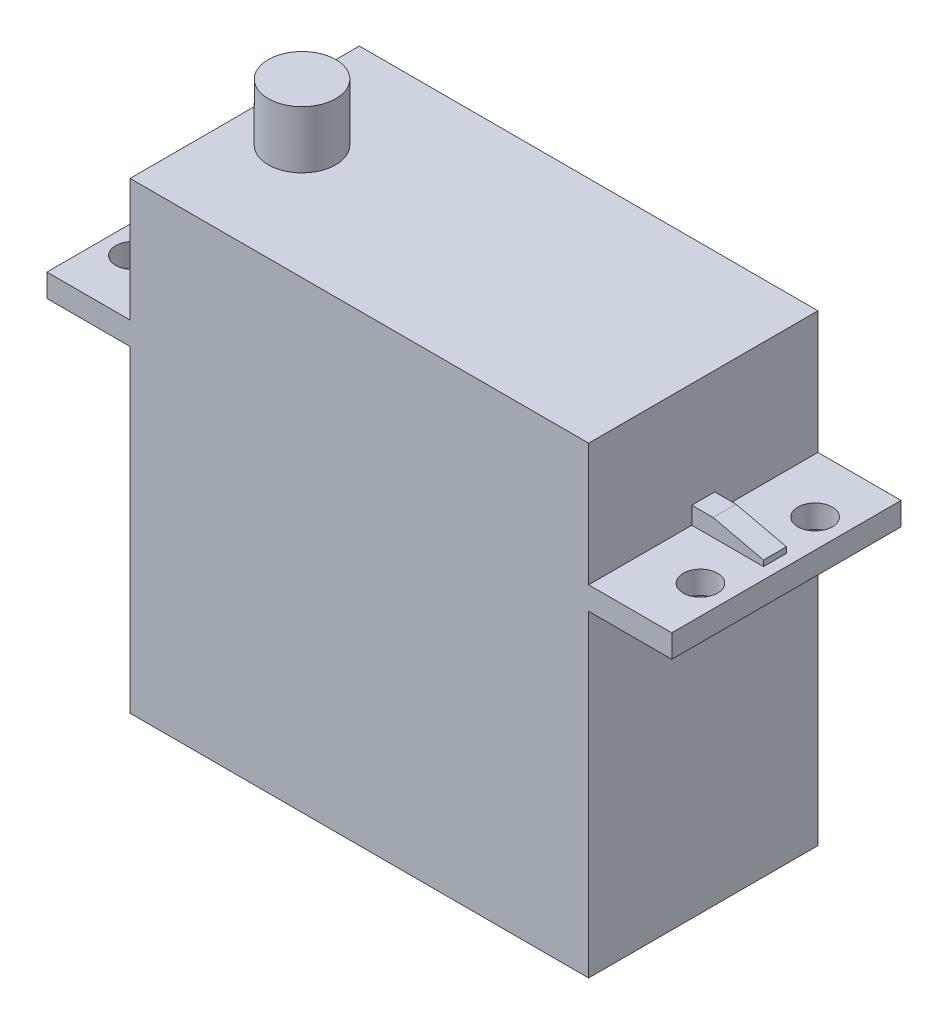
ISO-10303-21;
HEADER;
FILE_DESCRIPTION(('STEP AP214'),'2;1');
FILE_NAME('part.step','',(''),(''),'','','');
FILE_SCHEMA(('AUTOMOTIVE_DESIGN { 1 0 10303 214 1 1 1 1 }'));
ENDSEC;
DATA;
#1=APPLICATION_CONTEXT('core data for automotive mechanical design processes');
#2=APPLICATION_PROTOCOL_DEFINITION('international standard','automotive_design',2000,#1);
#3=PRODUCT_CONTEXT('',#1,'mechanical');
#4=PRODUCT('Part','Part','',(#3));
#5=PRODUCT_RELATED_PRODUCT_CATEGORY('part','',(#4));
#6=PRODUCT_DEFINITION_FORMATION('','',#4);
#7=PRODUCT_DEFINITION_CONTEXT('part definition',#1,'design');
#8=PRODUCT_DEFINITION('design','',#6,#7);
#9=PRODUCT_DEFINITION_SHAPE('','',#8);
#10=(LENGTH_UNIT() NAMED_UNIT(*) SI_UNIT(.MILLI.,.METRE.));
#11=(NAMED_UNIT(*) PLANE_ANGLE_UNIT() SI_UNIT($,.RADIAN.));
#12=(NAMED_UNIT(*) SI_UNIT($,.STERADIAN.) SOLID_ANGLE_UNIT());
#13=UNCERTAINTY_MEASURE_WITH_UNIT(LENGTH_MEASURE(1.E-05),#10,'distance_accuracy_value','');
#14=(GEOMETRIC_REPRESENTATION_CONTEXT(3) GLOBAL_UNCERTAINTY_ASSIGNED_CONTEXT((#13)) GLOBAL_UNIT_ASSIGNED_CONTEXT((#10,
#11,#12)) REPRESENTATION_CONTEXT('',''));
#15=CARTESIAN_POINT('',(0.,0.,0.));
#16=DIRECTION('',(0.,0.,1.));
#17=DIRECTION('',(1.,0.,0.));
#18=AXIS2_PLACEMENT_3D('',#15,#16,#17);
#19=CARTESIAN_POINT('',(20.,40.4,10.));
#20=DIRECTION('',(-1.,0.,0.));
#21=DIRECTION('',(0.,0.,1.));
#22=AXIS2_PLACEMENT_3D('',#19,#20,#21);
#23=PLANE('',#22);
#24=DIRECTION('',(0.,-1.,0.));
#25=VECTOR('',#24,1.);
#26=CARTESIAN_POINT('',(20.,31.2134680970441,-1.));
#27=LINE('',#26,#25);
#28=CARTESIAN_POINT('',(20.,31.2134680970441,-1.));
#29=VERTEX_POINT('',#28);
#30=CARTESIAN_POINT('',(20.,29.7,-1.));
#31=VERTEX_POINT('',#30);
#32=EDGE_CURVE('E214',#29,#31,#27,.T.);
#33=ORIENTED_EDGE('',*,*,#32,.T.);
#34=DIRECTION('',(0.,0.,1.));
#35=VECTOR('',#34,1.);
#36=CARTESIAN_POINT('',(20.,29.7,-17.5208044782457));
#37=LINE('',#36,#35);
#38=CARTESIAN_POINT('',(20.,29.7,-10.));
#39=VERTEX_POINT('',#38);
#40=EDGE_CURVE('E308',#39,#31,#37,.T.);
#41=ORIENTED_EDGE('',*,*,#40,.F.);
#42=DIRECTION('',(0.,-1.,0.));
#43=VECTOR('',#42,1.);
#44=CARTESIAN_POINT('',(20.,40.4,-10.));
#45=LINE('',#44,#43);
#46=CARTESIAN_POINT('',(20.,40.4,-10.));
#47=VERTEX_POINT('',#46);
#48=EDGE_CURVE('E54',#47,#39,#45,.T.);
#49=ORIENTED_EDGE('',*,*,#48,.F.);
#50=DIRECTION('',(0.,0.,-1.));
#51=VECTOR('',#50,1.);
#52=CARTESIAN_POINT('',(20.,40.4,10.));
#53=LINE('',#52,#51);
#54=CARTESIAN_POINT('',(20.,40.4,10.));
#55=VERTEX_POINT('',#54);
#56=EDGE_CURVE('E374',#55,#47,#53,.T.);
#57=ORIENTED_EDGE('',*,*,#56,.F.);
#58=DIRECTION('',(0.,-1.,0.));
#59=VECTOR('',#58,1.);
#60=CARTESIAN_POINT('',(20.,40.4,10.));
#61=LINE('',#60,#59);
#62=CARTESIAN_POINT('',(20.,29.7,10.));
#63=VERTEX_POINT('',#62);
#64=EDGE_CURVE('E403',#55,#63,#61,.T.);
#65=ORIENTED_EDGE('',*,*,#64,.T.);
#66=CARTESIAN_POINT('',(20.,29.7,1.));
#67=VERTEX_POINT('',#66);
#68=EDGE_CURVE('E312',#67,#63,#37,.T.);
#69=ORIENTED_EDGE('',*,*,#68,.F.);
#70=DIRECTION('',(0.,-1.,0.));
#71=VECTOR('',#70,1.);
#72=CARTESIAN_POINT('',(20.,31.2134680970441,1.));
#73=LINE('',#72,#71);
#74=CARTESIAN_POINT('',(20.,31.2134680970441,0.999999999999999));
#75=VERTEX_POINT('',#74);
#76=EDGE_CURVE('E66',#75,#67,#73,.T.);
#77=ORIENTED_EDGE('',*,*,#76,.F.);
#78=DIRECTION('',(0.,0.,1.));
#79=VECTOR('',#78,1.);
#80=CARTESIAN_POINT('',(20.,31.2134680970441,-1.));
#81=LINE('',#80,#79);
#82=EDGE_CURVE('E61',#29,#75,#81,.T.);
#83=ORIENTED_EDGE('',*,*,#82,.F.);
#84=EDGE_LOOP('',(#33,#41,#49,#57,#65,#69,#77,#83));
#85=FACE_BOUND('',#84,.T.);
#86=ADVANCED_FACE('F45',(#85),#23,.F.);
#87=CARTESIAN_POINT('',(27.25,29.7,-17.5208044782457));
#88=DIRECTION('',(0.,1.,0.));
#89=DIRECTION('',(0.,0.,1.));
#90=AXIS2_PLACEMENT_3D('',#87,#88,#89);
#91=PLANE('',#90);
#92=CARTESIAN_POINT('',(24.75,29.7,-5.));
#93=DIRECTION('',(0.,1.,0.));
#94=DIRECTION('',(0.,0.,-1.));
#95=AXIS2_PLACEMENT_3D('',#92,#93,#94);
#96=CIRCLE('',#95,1.5);
#97=CARTESIAN_POINT('',(24.75,29.7,-6.5));
#98=VERTEX_POINT('',#97);
#99=EDGE_CURVE('E793',#98,#98,#96,.T.);
#100=ORIENTED_EDGE('',*,*,#99,.F.);
#101=EDGE_LOOP('',(#100));
#102=FACE_BOUND('',#101,.T.);
#103=CARTESIAN_POINT('',(24.75,29.7,5.));
#104=DIRECTION('',(0.,1.,0.));
#105=DIRECTION('',(0.,0.,-1.));
#106=AXIS2_PLACEMENT_3D('',#103,#104,#105);
#107=CIRCLE('',#106,1.5);
#108=CARTESIAN_POINT('',(24.75,29.7,3.5));
#109=VERTEX_POINT('',#108);
#110=EDGE_CURVE('E802',#109,#109,#107,.T.);
#111=ORIENTED_EDGE('',*,*,#110,.F.);
#112=EDGE_LOOP('',(#111));
#113=FACE_BOUND('',#112,.T.);
#114=ORIENTED_EDGE('',*,*,#40,.T.);
#115=DIRECTION('',(1.,0.,0.));
#116=VECTOR('',#115,1.);
#117=CARTESIAN_POINT('',(20.,29.7,-1.));
#118=LINE('',#117,#116);
#119=CARTESIAN_POINT('',(26.25,29.7,-0.999999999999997));
#120=VERTEX_POINT('',#119);
#121=EDGE_CURVE('E225',#31,#120,#118,.T.);
#122=ORIENTED_EDGE('',*,*,#121,.T.);
#123=DIRECTION('',(0.,0.,1.));
#124=VECTOR('',#123,1.);
#125=CARTESIAN_POINT('',(26.25,29.7,-1.));
#126=LINE('',#125,#124);
#127=CARTESIAN_POINT('',(26.25,29.7,1.));
#128=VERTEX_POINT('',#127);
#129=EDGE_CURVE('E227',#120,#128,#126,.T.);
#130=ORIENTED_EDGE('',*,*,#129,.T.);
#131=DIRECTION('',(1.,0.,0.));
#132=VECTOR('',#131,1.);
#133=CARTESIAN_POINT('',(20.,29.7,1.));
#134=LINE('',#133,#132);
#135=EDGE_CURVE('E241',#67,#128,#134,.T.);
#136=ORIENTED_EDGE('',*,*,#135,.F.);
#137=ORIENTED_EDGE('',*,*,#68,.T.);
#138=DIRECTION('',(-1.,0.,0.));
#139=VECTOR('',#138,1.);
#140=CARTESIAN_POINT('',(27.25,29.7,10.));
#141=LINE('',#140,#139);
#142=CARTESIAN_POINT('',(27.25,29.7,10.));
#143=VERTEX_POINT('',#142);
#144=EDGE_CURVE('E323',#143,#63,#141,.T.);
#145=ORIENTED_EDGE('',*,*,#144,.F.);
#146=DIRECTION('',(0.,0.,1.));
#147=VECTOR('',#146,1.);
#148=CARTESIAN_POINT('',(27.25,29.7,-17.5208044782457));
#149=LINE('',#148,#147);
#150=CARTESIAN_POINT('',(27.25,29.7,-10.));
#151=VERTEX_POINT('',#150);
#152=EDGE_CURVE('E304',#151,#143,#149,.T.);
#153=ORIENTED_EDGE('',*,*,#152,.F.);
#154=DIRECTION('',(1.,0.,0.));
#155=VECTOR('',#154,1.);
#156=CARTESIAN_POINT('',(27.25,29.7,-10.));
#157=LINE('',#156,#155);
#158=EDGE_CURVE('E291',#39,#151,#157,.T.);
#159=ORIENTED_EDGE('',*,*,#158,.F.);
#160=EDGE_LOOP('',(#114,#122,#130,#136,#137,#145,#153,#159));
#161=FACE_BOUND('',#160,.T.);
#162=ADVANCED_FACE('F448',(#102,#113,#161),#91,.T.);
#163=CARTESIAN_POINT('',(-20.,40.4,10.));
#164=DIRECTION('',(1.,0.,0.));
#165=DIRECTION('',(0.,0.,-1.));
#166=AXIS2_PLACEMENT_3D('',#163,#164,#165);
#167=PLANE('',#166);
#168=DIRECTION('',(0.,0.,1.));
#169=VECTOR('',#168,1.);
#170=CARTESIAN_POINT('',(-20.,27.7,-17.5208044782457));
#171=LINE('',#170,#169);
#172=CARTESIAN_POINT('',(-20.,27.7,-10.));
#173=VERTEX_POINT('',#172);
#174=CARTESIAN_POINT('',(-20.,27.7,10.));
#175=VERTEX_POINT('',#174);
#176=EDGE_CURVE('E341',#173,#175,#171,.T.);
#177=ORIENTED_EDGE('',*,*,#176,.F.);
#178=DIRECTION('',(0.,-1.,0.));
#179=VECTOR('',#178,1.);
#180=CARTESIAN_POINT('',(-20.,40.4,-10.));
#181=LINE('',#180,#179);
#182=CARTESIAN_POINT('',(-20.,0.,-10.));
#183=VERTEX_POINT('',#182);
#184=EDGE_CURVE('E412',#173,#183,#181,.T.);
#185=ORIENTED_EDGE('',*,*,#184,.T.);
#186=DIRECTION('',(0.,0.,1.));
#187=VECTOR('',#186,1.);
#188=CARTESIAN_POINT('',(-20.,0.,10.));
#189=LINE('',#188,#187);
#190=CARTESIAN_POINT('',(-20.,0.,10.));
#191=VERTEX_POINT('',#190);
#192=EDGE_CURVE('E396',#183,#191,#189,.T.);
#193=ORIENTED_EDGE('',*,*,#192,.T.);
#194=DIRECTION('',(0.,-1.,0.));
#195=VECTOR('',#194,1.);
#196=CARTESIAN_POINT('',(-20.,40.4,10.));
#197=LINE('',#196,#195);
#198=EDGE_CURVE('E407',#175,#191,#197,.T.);
#199=ORIENTED_EDGE('',*,*,#198,.F.);
#200=EDGE_LOOP('',(#177,#185,#193,#199));
#201=FACE_BOUND('',#200,.T.);
#202=ADVANCED_FACE('F441',(#201),#167,.F.);
#203=CARTESIAN_POINT('',(20.,27.7,-10.));
#204=VERTEX_POINT('',#203);
#205=CARTESIAN_POINT('',(20.,0.,-10.));
#206=VERTEX_POINT('',#205);
#207=EDGE_CURVE('E415',#204,#206,#45,.T.);
#208=ORIENTED_EDGE('',*,*,#207,.F.);
#209=DIRECTION('',(0.,0.,1.));
#210=VECTOR('',#209,1.);
#211=CARTESIAN_POINT('',(20.,27.7,-17.5208044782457));
#212=LINE('',#211,#210);
#213=CARTESIAN_POINT('',(20.,27.7,10.));
#214=VERTEX_POINT('',#213);
#215=EDGE_CURVE('E313',#204,#214,#212,.T.);
#216=ORIENTED_EDGE('',*,*,#215,.T.);
#217=CARTESIAN_POINT('',(20.,0.,10.));
#218=VERTEX_POINT('',#217);
#219=EDGE_CURVE('E388',#214,#218,#61,.T.);
#220=ORIENTED_EDGE('',*,*,#219,.T.);
#221=DIRECTION('',(0.,0.,-1.));
#222=VECTOR('',#221,1.);
#223=CARTESIAN_POINT('',(20.,0.,10.));
#224=LINE('',#223,#222);
#225=EDGE_CURVE('E373',#218,#206,#224,.T.);
#226=ORIENTED_EDGE('',*,*,#225,.T.);
#227=EDGE_LOOP('',(#208,#216,#220,#226));
#228=FACE_BOUND('',#227,.T.);
#229=ADVANCED_FACE('F47',(#228),#23,.F.);
#230=CARTESIAN_POINT('',(-20.,40.4,-10.));
#231=DIRECTION('',(0.,0.,1.));
#232=DIRECTION('',(1.,0.,0.));
#233=AXIS2_PLACEMENT_3D('',#230,#231,#232);
#234=PLANE('',#233);
#235=DIRECTION('',(-1.,0.,0.));
#236=VECTOR('',#235,1.);
#237=CARTESIAN_POINT('',(-20.,0.,-10.));
#238=LINE('',#237,#236);
#239=EDGE_CURVE('E392',#206,#183,#238,.T.);
#240=ORIENTED_EDGE('',*,*,#239,.T.);
#241=ORIENTED_EDGE('',*,*,#184,.F.);
#242=DIRECTION('',(-1.,0.,0.));
#243=VECTOR('',#242,1.);
#244=CARTESIAN_POINT('',(-20.,27.7,-10.));
#245=LINE('',#244,#243);
#246=CARTESIAN_POINT('',(-27.25,27.7,-10.));
#247=VERTEX_POINT('',#246);
#248=EDGE_CURVE('E340',#173,#247,#245,.T.);
#249=ORIENTED_EDGE('',*,*,#248,.T.);
#250=DIRECTION('',(0.,1.,0.));
#251=VECTOR('',#250,1.);
#252=CARTESIAN_POINT('',(-27.25,27.7,-10.));
#253=LINE('',#252,#251);
#254=CARTESIAN_POINT('',(-27.25,29.7,-10.));
#255=VERTEX_POINT('',#254);
#256=EDGE_CURVE('E337',#247,#255,#253,.T.);
#257=ORIENTED_EDGE('',*,*,#256,.T.);
#258=DIRECTION('',(1.,0.,0.));
#259=VECTOR('',#258,1.);
#260=CARTESIAN_POINT('',(-27.25,29.7,-10.));
#261=LINE('',#260,#259);
#262=CARTESIAN_POINT('',(-20.,29.7,-10.));
#263=VERTEX_POINT('',#262);
#264=EDGE_CURVE('E344',#255,#263,#261,.T.);
#265=ORIENTED_EDGE('',*,*,#264,.T.);
#266=CARTESIAN_POINT('',(-20.,40.4,-10.));
#267=VERTEX_POINT('',#266);
#268=EDGE_CURVE('E413',#267,#263,#181,.T.);
#269=ORIENTED_EDGE('',*,*,#268,.F.);
#270=DIRECTION('',(-1.,0.,0.));
#271=VECTOR('',#270,1.);
#272=CARTESIAN_POINT('',(-20.,40.4,-10.));
#273=LINE('',#272,#271);
#274=EDGE_CURVE('E378',#47,#267,#273,.T.);
#275=ORIENTED_EDGE('',*,*,#274,.F.);
#276=ORIENTED_EDGE('',*,*,#48,.T.);
#277=ORIENTED_EDGE('',*,*,#158,.T.);
#278=DIRECTION('',(0.,-1.,0.));
#279=VECTOR('',#278,1.);
#280=CARTESIAN_POINT('',(27.25,27.7,-10.));
#281=LINE('',#280,#279);
#282=CARTESIAN_POINT('',(27.25,27.7,-10.));
#283=VERTEX_POINT('',#282);
#284=EDGE_CURVE('E303',#151,#283,#281,.T.);
#285=ORIENTED_EDGE('',*,*,#284,.T.);
#286=DIRECTION('',(-1.,0.,0.));
#287=VECTOR('',#286,1.);
#288=CARTESIAN_POINT('',(20.,27.7,-10.));
#289=LINE('',#288,#287);
#290=EDGE_CURVE('E319',#283,#204,#289,.T.);
#291=ORIENTED_EDGE('',*,*,#290,.T.);
#292=ORIENTED_EDGE('',*,*,#207,.T.);
#293=EDGE_LOOP('',(#240,#241,#249,#257,#265,#269,#275,#276,#277,#285,#291,#292));
#294=FACE_BOUND('',#293,.T.);
#295=ADVANCED_FACE('F423',(#294),#234,.F.);
#296=DIRECTION('',(0.,0.,1.));
#297=VECTOR('',#296,1.);
#298=CARTESIAN_POINT('',(-20.,29.7,-17.5208044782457));
#299=LINE('',#298,#297);
#300=CARTESIAN_POINT('',(-20.,29.7,-1.));
#301=VERTEX_POINT('',#300);
#302=EDGE_CURVE('E366',#263,#301,#299,.T.);
#303=ORIENTED_EDGE('',*,*,#302,.T.);
#304=DIRECTION('',(0.,1.,0.));
#305=VECTOR('',#304,1.);
#306=CARTESIAN_POINT('',(-20.,31.2134680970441,-1.));
#307=LINE('',#306,#305);
#308=CARTESIAN_POINT('',(-20.,31.2134680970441,-1.));
#309=VERTEX_POINT('',#308);
#310=EDGE_CURVE('E270',#301,#309,#307,.T.);
#311=ORIENTED_EDGE('',*,*,#310,.T.);
#312=DIRECTION('',(0.,0.,1.));
#313=VECTOR('',#312,1.);
#314=CARTESIAN_POINT('',(-20.,31.2134680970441,-1.));
#315=LINE('',#314,#313);
#316=CARTESIAN_POINT('',(-20.,31.2134680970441,1.));
#317=VERTEX_POINT('',#316);
#318=EDGE_CURVE('E286',#309,#317,#315,.T.);
#319=ORIENTED_EDGE('',*,*,#318,.T.);
#320=DIRECTION('',(0.,1.,0.));
#321=VECTOR('',#320,1.);
#322=CARTESIAN_POINT('',(-20.,31.2134680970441,1.));
#323=LINE('',#322,#321);
#324=CARTESIAN_POINT('',(-20.,29.7,1.));
#325=VERTEX_POINT('',#324);
#326=EDGE_CURVE('E252',#325,#317,#323,.T.);
#327=ORIENTED_EDGE('',*,*,#326,.F.);
#328=CARTESIAN_POINT('',(-20.,29.7,10.));
#329=VERTEX_POINT('',#328);
#330=EDGE_CURVE('E356',#325,#329,#299,.T.);
#331=ORIENTED_EDGE('',*,*,#330,.T.);
#332=CARTESIAN_POINT('',(-20.,40.4,10.));
#333=VERTEX_POINT('',#332);
#334=EDGE_CURVE('E408',#333,#329,#197,.T.);
#335=ORIENTED_EDGE('',*,*,#334,.F.);
#336=DIRECTION('',(0.,0.,1.));
#337=VECTOR('',#336,1.);
#338=CARTESIAN_POINT('',(-20.,40.4,10.));
#339=LINE('',#338,#337);
#340=EDGE_CURVE('E382',#267,#333,#339,.T.);
#341=ORIENTED_EDGE('',*,*,#340,.F.);
#342=ORIENTED_EDGE('',*,*,#268,.T.);
#343=EDGE_LOOP('',(#303,#311,#319,#327,#331,#335,#341,#342));
#344=FACE_BOUND('',#343,.T.);
#345=ADVANCED_FACE('F490',(#344),#167,.F.);
#346=CARTESIAN_POINT('',(-20.,40.4,10.));
#347=DIRECTION('',(0.,0.,-1.));
#348=DIRECTION('',(-1.,0.,0.));
#349=AXIS2_PLACEMENT_3D('',#346,#347,#348);
#350=PLANE('',#349);
#351=DIRECTION('',(1.,0.,0.));
#352=VECTOR('',#351,1.);
#353=CARTESIAN_POINT('',(-20.,0.,10.));
#354=LINE('',#353,#352);
#355=EDGE_CURVE('E379',#191,#218,#354,.T.);
#356=ORIENTED_EDGE('',*,*,#355,.T.);
#357=ORIENTED_EDGE('',*,*,#219,.F.);
#358=DIRECTION('',(1.,0.,0.));
#359=VECTOR('',#358,1.);
#360=CARTESIAN_POINT('',(20.,27.7,10.));
#361=LINE('',#360,#359);
#362=CARTESIAN_POINT('',(27.25,27.7,10.));
#363=VERTEX_POINT('',#362);
#364=EDGE_CURVE('E307',#214,#363,#361,.T.);
#365=ORIENTED_EDGE('',*,*,#364,.T.);
#366=DIRECTION('',(0.,1.,0.));
#367=VECTOR('',#366,1.);
#368=CARTESIAN_POINT('',(27.25,27.7,10.));
#369=LINE('',#368,#367);
#370=EDGE_CURVE('E327',#363,#143,#369,.T.);
#371=ORIENTED_EDGE('',*,*,#370,.T.);
#372=ORIENTED_EDGE('',*,*,#144,.T.);
#373=ORIENTED_EDGE('',*,*,#64,.F.);
#374=DIRECTION('',(1.,0.,0.));
#375=VECTOR('',#374,1.);
#376=CARTESIAN_POINT('',(-20.,40.4,10.));
#377=LINE('',#376,#375);
#378=EDGE_CURVE('E385',#333,#55,#377,.T.);
#379=ORIENTED_EDGE('',*,*,#378,.F.);
#380=ORIENTED_EDGE('',*,*,#334,.T.);
#381=DIRECTION('',(-1.,0.,0.));
#382=VECTOR('',#381,1.);
#383=CARTESIAN_POINT('',(-27.25,29.7,10.));
#384=LINE('',#383,#382);
#385=CARTESIAN_POINT('',(-27.25,29.7,10.));
#386=VERTEX_POINT('',#385);
#387=EDGE_CURVE('E331',#329,#386,#384,.T.);
#388=ORIENTED_EDGE('',*,*,#387,.T.);
#389=DIRECTION('',(0.,-1.,0.));
#390=VECTOR('',#389,1.);
#391=CARTESIAN_POINT('',(-27.25,27.7,10.));
#392=LINE('',#391,#390);
#393=CARTESIAN_POINT('',(-27.25,27.7,10.));
#394=VERTEX_POINT('',#393);
#395=EDGE_CURVE('E348',#386,#394,#392,.T.);
#396=ORIENTED_EDGE('',*,*,#395,.T.);
#397=DIRECTION('',(1.,0.,0.));
#398=VECTOR('',#397,1.);
#399=CARTESIAN_POINT('',(-20.,27.7,10.));
#400=LINE('',#399,#398);
#401=EDGE_CURVE('E352',#394,#175,#400,.T.);
#402=ORIENTED_EDGE('',*,*,#401,.T.);
#403=ORIENTED_EDGE('',*,*,#198,.T.);
#404=EDGE_LOOP('',(#356,#357,#365,#371,#372,#373,#379,#380,#388,#396,#402,#403));
#405=FACE_BOUND('',#404,.T.);
#406=ADVANCED_FACE('F437',(#405),#350,.F.);
#407=CARTESIAN_POINT('',(0.,40.4,0.));
#408=DIRECTION('',(0.,-1.,0.));
#409=DIRECTION('',(0.,0.,-1.));
#410=AXIS2_PLACEMENT_3D('',#407,#408,#409);
#411=PLANE('',#410);
#412=CARTESIAN_POINT('',(-15.,40.4,0.));
#413=DIRECTION('',(0.,-1.,0.));
#414=DIRECTION('',(0.,0.,-1.));
#415=AXIS2_PLACEMENT_3D('',#412,#413,#414);
#416=CIRCLE('',#415,2.95);
#417=CARTESIAN_POINT('',(-15.,40.4,-2.95));
#418=VERTEX_POINT('',#417);
#419=EDGE_CURVE('E11',#418,#418,#416,.F.);
#420=ORIENTED_EDGE('',*,*,#419,.F.);
#421=EDGE_LOOP('',(#420));
#422=FACE_BOUND('',#421,.T.);
#423=ORIENTED_EDGE('',*,*,#56,.T.);
#424=ORIENTED_EDGE('',*,*,#274,.T.);
#425=ORIENTED_EDGE('',*,*,#340,.T.);
#426=ORIENTED_EDGE('',*,*,#378,.T.);
#427=EDGE_LOOP('',(#423,#424,#425,#426));
#428=FACE_BOUND('',#427,.T.);
#429=ADVANCED_FACE('F500',(#422,#428),#411,.F.);
#430=CARTESIAN_POINT('',(0.,0.,0.));
#431=DIRECTION('',(0.,-1.,0.));
#432=DIRECTION('',(0.,0.,-1.));
#433=AXIS2_PLACEMENT_3D('',#430,#431,#432);
#434=PLANE('',#433);
#435=ORIENTED_EDGE('',*,*,#225,.F.);
#436=ORIENTED_EDGE('',*,*,#355,.F.);
#437=ORIENTED_EDGE('',*,*,#192,.F.);
#438=ORIENTED_EDGE('',*,*,#239,.F.);
#439=EDGE_LOOP('',(#435,#436,#437,#438));
#440=FACE_BOUND('',#439,.T.);
#441=ADVANCED_FACE('F431',(#440),#434,.T.);
#442=CARTESIAN_POINT('',(-20.,27.7,-17.5208044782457));
#443=DIRECTION('',(0.,-1.,0.));
#444=DIRECTION('',(0.,0.,-1.));
#445=AXIS2_PLACEMENT_3D('',#442,#443,#444);
#446=PLANE('',#445);
#447=CARTESIAN_POINT('',(-24.75,27.7,5.));
#448=DIRECTION('',(0.,1.,0.));
#449=DIRECTION('',(0.,0.,1.));
#450=AXIS2_PLACEMENT_3D('',#447,#448,#449);
#451=CIRCLE('',#450,1.5);
#452=CARTESIAN_POINT('',(-24.75,27.7,6.5));
#453=VERTEX_POINT('',#452);
#454=EDGE_CURVE('E806',#453,#453,#451,.T.);
#455=ORIENTED_EDGE('',*,*,#454,.T.);
#456=EDGE_LOOP('',(#455));
#457=FACE_BOUND('',#456,.T.);
#458=CARTESIAN_POINT('',(-24.75,27.7,-5.));
#459=DIRECTION('',(0.,1.,0.));
#460=DIRECTION('',(0.,0.,1.));
#461=AXIS2_PLACEMENT_3D('',#458,#459,#460);
#462=CIRCLE('',#461,1.5);
#463=CARTESIAN_POINT('',(-24.75,27.7,-3.5));
#464=VERTEX_POINT('',#463);
#465=EDGE_CURVE('E206',#464,#464,#462,.T.);
#466=ORIENTED_EDGE('',*,*,#465,.T.);
#467=EDGE_LOOP('',(#466));
#468=FACE_BOUND('',#467,.T.);
#469=ORIENTED_EDGE('',*,*,#248,.F.);
#470=ORIENTED_EDGE('',*,*,#176,.T.);
#471=ORIENTED_EDGE('',*,*,#401,.F.);
#472=DIRECTION('',(0.,0.,1.));
#473=VECTOR('',#472,1.);
#474=CARTESIAN_POINT('',(-27.25,27.7,-17.5208044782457));
#475=LINE('',#474,#473);
#476=EDGE_CURVE('E360',#247,#394,#475,.T.);
#477=ORIENTED_EDGE('',*,*,#476,.F.);
#478=EDGE_LOOP('',(#469,#470,#471,#477));
#479=FACE_BOUND('',#478,.T.);
#480=ADVANCED_FACE('F532',(#457,#468,#479),#446,.T.);
#481=CARTESIAN_POINT('',(-27.25,27.7,-17.5208044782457));
#482=DIRECTION('',(-1.,0.,0.));
#483=DIRECTION('',(0.,0.,1.));
#484=AXIS2_PLACEMENT_3D('',#481,#482,#483);
#485=PLANE('',#484);
#486=ORIENTED_EDGE('',*,*,#256,.F.);
#487=ORIENTED_EDGE('',*,*,#476,.T.);
#488=ORIENTED_EDGE('',*,*,#395,.F.);
#489=DIRECTION('',(0.,0.,1.));
#490=VECTOR('',#489,1.);
#491=CARTESIAN_POINT('',(-27.25,29.7,-17.5208044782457));
#492=LINE('',#491,#490);
#493=EDGE_CURVE('E363',#255,#386,#492,.T.);
#494=ORIENTED_EDGE('',*,*,#493,.F.);
#495=EDGE_LOOP('',(#486,#487,#488,#494));
#496=FACE_BOUND('',#495,.T.);
#497=ADVANCED_FACE('F530',(#496),#485,.T.);
#498=CARTESIAN_POINT('',(-27.25,29.7,-17.5208044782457));
#499=DIRECTION('',(0.,1.,0.));
#500=DIRECTION('',(0.,0.,1.));
#501=AXIS2_PLACEMENT_3D('',#498,#499,#500);
#502=PLANE('',#501);
#503=CARTESIAN_POINT('',(-24.75,29.7,5.));
#504=DIRECTION('',(0.,1.,0.));
#505=DIRECTION('',(0.,0.,1.));
#506=AXIS2_PLACEMENT_3D('',#503,#504,#505);
#507=CIRCLE('',#506,1.5);
#508=CARTESIAN_POINT('',(-24.75,29.7,6.5));
#509=VERTEX_POINT('',#508);
#510=EDGE_CURVE('E786',#509,#509,#507,.T.);
#511=ORIENTED_EDGE('',*,*,#510,.F.);
#512=EDGE_LOOP('',(#511));
#513=FACE_BOUND('',#512,.T.);
#514=CARTESIAN_POINT('',(-24.75,29.7,-5.));
#515=DIRECTION('',(0.,1.,0.));
#516=DIRECTION('',(0.,0.,1.));
#517=AXIS2_PLACEMENT_3D('',#514,#515,#516);
#518=CIRCLE('',#517,1.5);
#519=CARTESIAN_POINT('',(-24.75,29.7,-3.5));
#520=VERTEX_POINT('',#519);
#521=EDGE_CURVE('E782',#520,#520,#518,.T.);
#522=ORIENTED_EDGE('',*,*,#521,.F.);
#523=EDGE_LOOP('',(#522));
#524=FACE_BOUND('',#523,.T.);
#525=DIRECTION('',(1.,0.,0.));
#526=VECTOR('',#525,1.);
#527=CARTESIAN_POINT('',(-20.,29.7,-1.));
#528=LINE('',#527,#526);
#529=CARTESIAN_POINT('',(-26.25,29.7,-1.));
#530=VERTEX_POINT('',#529);
#531=EDGE_CURVE('E266',#530,#301,#528,.T.);
#532=ORIENTED_EDGE('',*,*,#531,.T.);
#533=ORIENTED_EDGE('',*,*,#302,.F.);
#534=ORIENTED_EDGE('',*,*,#264,.F.);
#535=ORIENTED_EDGE('',*,*,#493,.T.);
#536=ORIENTED_EDGE('',*,*,#387,.F.);
#537=ORIENTED_EDGE('',*,*,#330,.F.);
#538=DIRECTION('',(1.,0.,0.));
#539=VECTOR('',#538,1.);
#540=CARTESIAN_POINT('',(-20.,29.7,1.));
#541=LINE('',#540,#539);
#542=CARTESIAN_POINT('',(-26.25,29.7,1.));
#543=VERTEX_POINT('',#542);
#544=EDGE_CURVE('E249',#543,#325,#541,.T.);
#545=ORIENTED_EDGE('',*,*,#544,.F.);
#546=DIRECTION('',(0.,0.,1.));
#547=VECTOR('',#546,1.);
#548=CARTESIAN_POINT('',(-26.25,29.7,-1.));
#549=LINE('',#548,#547);
#550=EDGE_CURVE('E287',#530,#543,#549,.T.);
#551=ORIENTED_EDGE('',*,*,#550,.F.);
#552=EDGE_LOOP('',(#532,#533,#534,#535,#536,#537,#545,#551));
#553=FACE_BOUND('',#552,.T.);
#554=ADVANCED_FACE('F473',(#513,#524,#553),#502,.T.);
#555=CARTESIAN_POINT('',(27.25,27.7,-17.5208044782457));
#556=DIRECTION('',(1.,0.,0.));
#557=DIRECTION('',(0.,0.,-1.));
#558=AXIS2_PLACEMENT_3D('',#555,#556,#557);
#559=PLANE('',#558);
#560=ORIENTED_EDGE('',*,*,#284,.F.);
#561=ORIENTED_EDGE('',*,*,#152,.T.);
#562=ORIENTED_EDGE('',*,*,#370,.F.);
#563=DIRECTION('',(0.,0.,1.));
#564=VECTOR('',#563,1.);
#565=CARTESIAN_POINT('',(27.25,27.7,-17.5208044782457));
#566=LINE('',#565,#564);
#567=EDGE_CURVE('E316',#283,#363,#566,.T.);
#568=ORIENTED_EDGE('',*,*,#567,.F.);
#569=EDGE_LOOP('',(#560,#561,#562,#568));
#570=FACE_BOUND('',#569,.T.);
#571=ADVANCED_FACE('F457',(#570),#559,.T.);
#572=CARTESIAN_POINT('',(20.,27.7,-17.5208044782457));
#573=DIRECTION('',(0.,-1.,0.));
#574=DIRECTION('',(0.,0.,-1.));
#575=AXIS2_PLACEMENT_3D('',#572,#573,#574);
#576=PLANE('',#575);
#577=CARTESIAN_POINT('',(24.75,27.7,-5.));
#578=DIRECTION('',(0.,1.,0.));
#579=DIRECTION('',(0.,0.,-1.));
#580=AXIS2_PLACEMENT_3D('',#577,#578,#579);
#581=CIRCLE('',#580,1.5);
#582=CARTESIAN_POINT('',(24.75,27.7,-6.5));
#583=VERTEX_POINT('',#582);
#584=EDGE_CURVE('E790',#583,#583,#581,.T.);
#585=ORIENTED_EDGE('',*,*,#584,.T.);
#586=EDGE_LOOP('',(#585));
#587=FACE_BOUND('',#586,.T.);
#588=CARTESIAN_POINT('',(24.75,27.7,5.));
#589=DIRECTION('',(0.,1.,0.));
#590=DIRECTION('',(0.,0.,-1.));
#591=AXIS2_PLACEMENT_3D('',#588,#589,#590);
#592=CIRCLE('',#591,1.5);
#593=CARTESIAN_POINT('',(24.75,27.7,3.5));
#594=VERTEX_POINT('',#593);
#595=EDGE_CURVE('E798',#594,#594,#592,.T.);
#596=ORIENTED_EDGE('',*,*,#595,.T.);
#597=EDGE_LOOP('',(#596));
#598=FACE_BOUND('',#597,.T.);
#599=ORIENTED_EDGE('',*,*,#290,.F.);
#600=ORIENTED_EDGE('',*,*,#567,.T.);
#601=ORIENTED_EDGE('',*,*,#364,.F.);
#602=ORIENTED_EDGE('',*,*,#215,.F.);
#603=EDGE_LOOP('',(#599,#600,#601,#602));
#604=FACE_BOUND('',#603,.T.);
#605=ADVANCED_FACE('F459',(#587,#598,#604),#576,.T.);
#606=CARTESIAN_POINT('',(-26.25,29.7,-1.));
#607=DIRECTION('',(-1.,0.,0.));
#608=DIRECTION('',(0.,0.,1.));
#609=AXIS2_PLACEMENT_3D('',#606,#607,#608);
#610=PLANE('',#609);
#611=ORIENTED_EDGE('',*,*,#550,.T.);
#612=DIRECTION('',(0.,-1.,0.));
#613=VECTOR('',#612,1.);
#614=CARTESIAN_POINT('',(-26.25,29.7,1.));
#615=LINE('',#614,#613);
#616=CARTESIAN_POINT('',(-26.25,30.2,1.));
#617=VERTEX_POINT('',#616);
#618=EDGE_CURVE('E263',#617,#543,#615,.T.);
#619=ORIENTED_EDGE('',*,*,#618,.F.);
#620=DIRECTION('',(0.,0.,1.));
#621=VECTOR('',#620,1.);
#622=CARTESIAN_POINT('',(-26.25,30.2,-1.));
#623=LINE('',#622,#621);
#624=CARTESIAN_POINT('',(-26.25,30.2,-1.));
#625=VERTEX_POINT('',#624);
#626=EDGE_CURVE('E292',#625,#617,#623,.T.);
#627=ORIENTED_EDGE('',*,*,#626,.F.);
#628=DIRECTION('',(0.,-1.,0.));
#629=VECTOR('',#628,1.);
#630=CARTESIAN_POINT('',(-26.25,29.7,-1.));
#631=LINE('',#630,#629);
#632=EDGE_CURVE('E282',#625,#530,#631,.T.);
#633=ORIENTED_EDGE('',*,*,#632,.T.);
#634=EDGE_LOOP('',(#611,#619,#627,#633));
#635=FACE_BOUND('',#634,.T.);
#636=ADVANCED_FACE('F461',(#635),#610,.T.);
#637=CARTESIAN_POINT('',(-26.25,30.2,-1.));
#638=DIRECTION('',(-0.224951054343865,0.974370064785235,0.));
#639=DIRECTION('',(-0.974370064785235,-0.224951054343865,0.));
#640=AXIS2_PLACEMENT_3D('',#637,#638,#639);
#641=PLANE('',#640);
#642=ORIENTED_EDGE('',*,*,#626,.T.);
#643=DIRECTION('',(-0.974370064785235,-0.224951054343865,0.));
#644=VECTOR('',#643,1.);
#645=CARTESIAN_POINT('',(-26.25,30.2,1.));
#646=LINE('',#645,#644);
#647=CARTESIAN_POINT('',(-21.8601873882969,31.2134680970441,1.));
#648=VERTEX_POINT('',#647);
#649=EDGE_CURVE('E259',#648,#617,#646,.T.);
#650=ORIENTED_EDGE('',*,*,#649,.F.);
#651=DIRECTION('',(0.,0.,1.));
#652=VECTOR('',#651,1.);
#653=CARTESIAN_POINT('',(-21.8601873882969,31.2134680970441,-1.));
#654=LINE('',#653,#652);
#655=CARTESIAN_POINT('',(-21.8601873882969,31.2134680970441,-1.));
#656=VERTEX_POINT('',#655);
#657=EDGE_CURVE('E295',#656,#648,#654,.T.);
#658=ORIENTED_EDGE('',*,*,#657,.F.);
#659=DIRECTION('',(-0.974370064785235,-0.224951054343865,0.));
#660=VECTOR('',#659,1.);
#661=CARTESIAN_POINT('',(-26.25,30.2,-1.));
#662=LINE('',#661,#660);
#663=EDGE_CURVE('E278',#656,#625,#662,.T.);
#664=ORIENTED_EDGE('',*,*,#663,.T.);
#665=EDGE_LOOP('',(#642,#650,#658,#664));
#666=FACE_BOUND('',#665,.T.);
#667=ADVANCED_FACE('F469',(#666),#641,.T.);
#668=CARTESIAN_POINT('',(-21.8601873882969,31.2134680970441,-1.));
#669=DIRECTION('',(0.,1.,0.));
#670=DIRECTION('',(0.,0.,1.));
#671=AXIS2_PLACEMENT_3D('',#668,#669,#670);
#672=PLANE('',#671);
#673=ORIENTED_EDGE('',*,*,#657,.T.);
#674=DIRECTION('',(-1.,0.,0.));
#675=VECTOR('',#674,1.);
#676=CARTESIAN_POINT('',(-21.8601873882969,31.2134680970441,1.));
#677=LINE('',#676,#675);
#678=EDGE_CURVE('E255',#317,#648,#677,.T.);
#679=ORIENTED_EDGE('',*,*,#678,.F.);
#680=ORIENTED_EDGE('',*,*,#318,.F.);
#681=DIRECTION('',(-1.,0.,0.));
#682=VECTOR('',#681,1.);
#683=CARTESIAN_POINT('',(-21.8601873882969,31.2134680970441,-1.));
#684=LINE('',#683,#682);
#685=EDGE_CURVE('E274',#309,#656,#684,.T.);
#686=ORIENTED_EDGE('',*,*,#685,.T.);
#687=EDGE_LOOP('',(#673,#679,#680,#686));
#688=FACE_BOUND('',#687,.T.);
#689=ADVANCED_FACE('F517',(#688),#672,.T.);
#690=CARTESIAN_POINT('',(0.,0.,-1.));
#691=DIRECTION('',(0.,0.,-1.));
#692=DIRECTION('',(-1.,0.,0.));
#693=AXIS2_PLACEMENT_3D('',#690,#691,#692);
#694=PLANE('',#693);
#695=ORIENTED_EDGE('',*,*,#531,.F.);
#696=ORIENTED_EDGE('',*,*,#632,.F.);
#697=ORIENTED_EDGE('',*,*,#663,.F.);
#698=ORIENTED_EDGE('',*,*,#685,.F.);
#699=ORIENTED_EDGE('',*,*,#310,.F.);
#700=EDGE_LOOP('',(#695,#696,#697,#698,#699));
#701=FACE_BOUND('',#700,.T.);
#702=ADVANCED_FACE('F510',(#701),#694,.T.);
#703=CARTESIAN_POINT('',(0.,0.,1.));
#704=DIRECTION('',(0.,0.,-1.));
#705=DIRECTION('',(-1.,0.,0.));
#706=AXIS2_PLACEMENT_3D('',#703,#704,#705);
#707=PLANE('',#706);
#708=ORIENTED_EDGE('',*,*,#544,.T.);
#709=ORIENTED_EDGE('',*,*,#326,.T.);
#710=ORIENTED_EDGE('',*,*,#678,.T.);
#711=ORIENTED_EDGE('',*,*,#649,.T.);
#712=ORIENTED_EDGE('',*,*,#618,.T.);
#713=EDGE_LOOP('',(#708,#709,#710,#711,#712));
#714=FACE_BOUND('',#713,.T.);
#715=ADVANCED_FACE('F581',(#714),#707,.F.);
#716=CARTESIAN_POINT('',(21.8601873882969,31.2134680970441,-1.));
#717=DIRECTION('',(0.,1.,0.));
#718=DIRECTION('',(0.,0.,1.));
#719=AXIS2_PLACEMENT_3D('',#716,#717,#718);
#720=PLANE('',#719);
#721=ORIENTED_EDGE('',*,*,#82,.T.);
#722=DIRECTION('',(-1.,0.,0.));
#723=VECTOR('',#722,1.);
#724=CARTESIAN_POINT('',(21.8601873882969,31.2134680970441,1.));
#725=LINE('',#724,#723);
#726=CARTESIAN_POINT('',(21.8601873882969,31.2134680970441,1.));
#727=VERTEX_POINT('',#726);
#728=EDGE_CURVE('E199',#727,#75,#725,.T.);
#729=ORIENTED_EDGE('',*,*,#728,.F.);
#730=DIRECTION('',(0.,0.,1.));
#731=VECTOR('',#730,1.);
#732=CARTESIAN_POINT('',(21.8601873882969,31.2134680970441,-1.));
#733=LINE('',#732,#731);
#734=CARTESIAN_POINT('',(21.8601873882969,31.2134680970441,-1.));
#735=VERTEX_POINT('',#734);
#736=EDGE_CURVE('E194',#735,#727,#733,.T.);
#737=ORIENTED_EDGE('',*,*,#736,.F.);
#738=DIRECTION('',(-1.,0.,0.));
#739=VECTOR('',#738,1.);
#740=CARTESIAN_POINT('',(21.8601873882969,31.2134680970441,-1.));
#741=LINE('',#740,#739);
#742=EDGE_CURVE('E197',#735,#29,#741,.T.);
#743=ORIENTED_EDGE('',*,*,#742,.T.);
#744=EDGE_LOOP('',(#721,#729,#737,#743));
#745=FACE_BOUND('',#744,.T.);
#746=ADVANCED_FACE('F196',(#745),#720,.T.);
#747=CARTESIAN_POINT('',(26.25,30.2,-1.));
#748=DIRECTION('',(0.224951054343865,0.974370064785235,0.));
#749=DIRECTION('',(-0.974370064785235,0.224951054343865,0.));
#750=AXIS2_PLACEMENT_3D('',#747,#748,#749);
#751=PLANE('',#750);
#752=ORIENTED_EDGE('',*,*,#736,.T.);
#753=DIRECTION('',(-0.974370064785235,0.224951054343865,0.));
#754=VECTOR('',#753,1.);
#755=CARTESIAN_POINT('',(26.25,30.2,1.));
#756=LINE('',#755,#754);
#757=CARTESIAN_POINT('',(26.25,30.2,1.));
#758=VERTEX_POINT('',#757);
#759=EDGE_CURVE('E216',#758,#727,#756,.T.);
#760=ORIENTED_EDGE('',*,*,#759,.F.);
#761=DIRECTION('',(0.,0.,1.));
#762=VECTOR('',#761,1.);
#763=CARTESIAN_POINT('',(26.25,30.2,-1.));
#764=LINE('',#763,#762);
#765=CARTESIAN_POINT('',(26.25,30.2,-1.));
#766=VERTEX_POINT('',#765);
#767=EDGE_CURVE('E205',#766,#758,#764,.T.);
#768=ORIENTED_EDGE('',*,*,#767,.F.);
#769=DIRECTION('',(-0.974370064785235,0.224951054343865,0.));
#770=VECTOR('',#769,1.);
#771=CARTESIAN_POINT('',(26.25,30.2,-1.));
#772=LINE('',#771,#770);
#773=EDGE_CURVE('E212',#766,#735,#772,.T.);
#774=ORIENTED_EDGE('',*,*,#773,.T.);
#775=EDGE_LOOP('',(#752,#760,#768,#774));
#776=FACE_BOUND('',#775,.T.);
#777=ADVANCED_FACE('F218',(#776),#751,.T.);
#778=CARTESIAN_POINT('',(26.25,29.7,-1.));
#779=DIRECTION('',(1.,0.,0.));
#780=DIRECTION('',(0.,0.,-1.));
#781=AXIS2_PLACEMENT_3D('',#778,#779,#780);
#782=PLANE('',#781);
#783=ORIENTED_EDGE('',*,*,#767,.T.);
#784=DIRECTION('',(0.,1.,0.));
#785=VECTOR('',#784,1.);
#786=CARTESIAN_POINT('',(26.25,29.7,1.));
#787=LINE('',#786,#785);
#788=EDGE_CURVE('E237',#128,#758,#787,.T.);
#789=ORIENTED_EDGE('',*,*,#788,.F.);
#790=ORIENTED_EDGE('',*,*,#129,.F.);
#791=DIRECTION('',(0.,1.,0.));
#792=VECTOR('',#791,1.);
#793=CARTESIAN_POINT('',(26.25,29.7,-1.));
#794=LINE('',#793,#792);
#795=EDGE_CURVE('E221',#120,#766,#794,.T.);
#796=ORIENTED_EDGE('',*,*,#795,.T.);
#797=EDGE_LOOP('',(#783,#789,#790,#796));
#798=FACE_BOUND('',#797,.T.);
#799=ADVANCED_FACE('F582',(#798),#782,.T.);
#800=CARTESIAN_POINT('',(0.,0.,-1.));
#801=DIRECTION('',(0.,0.,1.));
#802=DIRECTION('',(1.,0.,0.));
#803=AXIS2_PLACEMENT_3D('',#800,#801,#802);
#804=PLANE('',#803);
#805=ORIENTED_EDGE('',*,*,#742,.F.);
#806=ORIENTED_EDGE('',*,*,#773,.F.);
#807=ORIENTED_EDGE('',*,*,#795,.F.);
#808=ORIENTED_EDGE('',*,*,#121,.F.);
#809=ORIENTED_EDGE('',*,*,#32,.F.);
#810=EDGE_LOOP('',(#805,#806,#807,#808,#809));
#811=FACE_BOUND('',#810,.T.);
#812=ADVANCED_FACE('F210',(#811),#804,.F.);
#813=CARTESIAN_POINT('',(0.,0.,1.));
#814=DIRECTION('',(0.,0.,1.));
#815=DIRECTION('',(1.,0.,0.));
#816=AXIS2_PLACEMENT_3D('',#813,#814,#815);
#817=PLANE('',#816);
#818=ORIENTED_EDGE('',*,*,#728,.T.);
#819=ORIENTED_EDGE('',*,*,#76,.T.);
#820=ORIENTED_EDGE('',*,*,#135,.T.);
#821=ORIENTED_EDGE('',*,*,#788,.T.);
#822=ORIENTED_EDGE('',*,*,#759,.T.);
#823=EDGE_LOOP('',(#818,#819,#820,#821,#822));
#824=FACE_BOUND('',#823,.T.);
#825=ADVANCED_FACE('F571',(#824),#817,.T.);
#826=CARTESIAN_POINT('',(24.75,27.7,5.));
#827=DIRECTION('',(0.,1.,0.));
#828=DIRECTION('',(0.,0.,1.));
#829=AXIS2_PLACEMENT_3D('',#826,#827,#828);
#830=CYLINDRICAL_SURFACE('',#829,1.5);
#831=ORIENTED_EDGE('',*,*,#595,.F.);
#832=EDGE_LOOP('',(#831));
#833=FACE_BOUND('',#832,.T.);
#834=ORIENTED_EDGE('',*,*,#110,.T.);
#835=EDGE_LOOP('',(#834));
#836=FACE_BOUND('',#835,.T.);
#837=ADVANCED_FACE('F568',(#833,#836),#830,.F.);
#838=CARTESIAN_POINT('',(24.75,27.7,-5.));
#839=DIRECTION('',(0.,1.,0.));
#840=DIRECTION('',(0.,0.,1.));
#841=AXIS2_PLACEMENT_3D('',#838,#839,#840);
#842=CYLINDRICAL_SURFACE('',#841,1.5);
#843=ORIENTED_EDGE('',*,*,#584,.F.);
#844=EDGE_LOOP('',(#843));
#845=FACE_BOUND('',#844,.T.);
#846=ORIENTED_EDGE('',*,*,#99,.T.);
#847=EDGE_LOOP('',(#846));
#848=FACE_BOUND('',#847,.T.);
#849=ADVANCED_FACE('F570',(#845,#848),#842,.F.);
#850=CARTESIAN_POINT('',(-24.75,27.7,-5.));
#851=DIRECTION('',(0.,1.,0.));
#852=DIRECTION('',(0.,0.,1.));
#853=AXIS2_PLACEMENT_3D('',#850,#851,#852);
#854=CYLINDRICAL_SURFACE('',#853,1.5);
#855=ORIENTED_EDGE('',*,*,#465,.F.);
#856=EDGE_LOOP('',(#855));
#857=FACE_BOUND('',#856,.T.);
#858=ORIENTED_EDGE('',*,*,#521,.T.);
#859=EDGE_LOOP('',(#858));
#860=FACE_BOUND('',#859,.T.);
#861=ADVANCED_FACE('F563',(#857,#860),#854,.F.);
#862=CARTESIAN_POINT('',(-24.75,27.7,5.));
#863=DIRECTION('',(0.,1.,0.));
#864=DIRECTION('',(0.,0.,1.));
#865=AXIS2_PLACEMENT_3D('',#862,#863,#864);
#866=CYLINDRICAL_SURFACE('',#865,1.5);
#867=ORIENTED_EDGE('',*,*,#454,.F.);
#868=EDGE_LOOP('',(#867));
#869=FACE_BOUND('',#868,.T.);
#870=ORIENTED_EDGE('',*,*,#510,.T.);
#871=EDGE_LOOP('',(#870));
#872=FACE_BOUND('',#871,.T.);
#873=ADVANCED_FACE('F555',(#869,#872),#866,.F.);
#874=CARTESIAN_POINT('',(-15.,45.4,0.));
#875=DIRECTION('',(0.,-1.,0.));
#876=DIRECTION('',(0.,0.,-1.));
#877=AXIS2_PLACEMENT_3D('',#874,#875,#876);
#878=CYLINDRICAL_SURFACE('',#877,2.95);
#879=CARTESIAN_POINT('',(-15.,45.4,0.));
#880=DIRECTION('',(0.,1.,0.));
#881=DIRECTION('',(0.,0.,1.));
#882=AXIS2_PLACEMENT_3D('',#879,#880,#881);
#883=CIRCLE('',#882,2.95);
#884=CARTESIAN_POINT('',(-15.,45.4,2.95));
#885=VERTEX_POINT('',#884);
#886=EDGE_CURVE('E794',#885,#885,#883,.T.);
#887=ORIENTED_EDGE('',*,*,#886,.F.);
#888=EDGE_LOOP('',(#887));
#889=FACE_BOUND('',#888,.T.);
#890=ORIENTED_EDGE('',*,*,#419,.T.);
#891=EDGE_LOOP('',(#890));
#892=FACE_BOUND('',#891,.T.);
#893=ADVANCED_FACE('F553',(#889,#892),#878,.T.);
#894=CARTESIAN_POINT('',(-15.,45.4,0.));
#895=DIRECTION('',(0.,1.,0.));
#896=DIRECTION('',(0.,0.,1.));
#897=AXIS2_PLACEMENT_3D('',#894,#895,#896);
#898=PLANE('',#897);
#899=ORIENTED_EDGE('',*,*,#886,.T.);
#900=EDGE_LOOP('',(#899));
#901=FACE_BOUND('',#900,.T.);
#902=ADVANCED_FACE('F554',(#901),#898,.T.);
#903=CLOSED_SHELL('',(#86,#162,#202,#229,#295,#345,#406,#429,#441,#480,#497,#554,#571,#605,#636,
#667,#689,#702,#715,#746,#777,#799,#812,#825,#837,#849,#861,#873,#893,#902));
#904=MANIFOLD_SOLID_BREP('B2',#903);
#905=ADVANCED_BREP_SHAPE_REPRESENTATION('',(#18,#904),#14);
#906=SHAPE_DEFINITION_REPRESENTATION(#9,#905);
ENDSEC;
END-ISO-10303-21;
